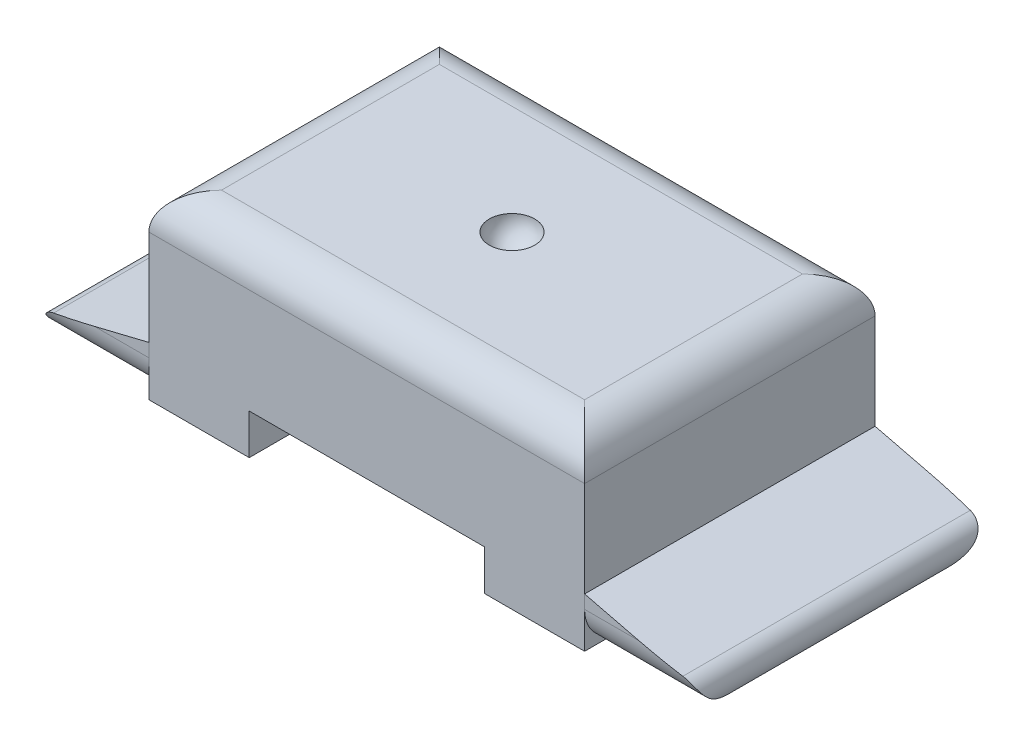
ISO-10303-21;
HEADER;
FILE_DESCRIPTION(('STEP AP214'),'2;1');
FILE_NAME('part.step','',(''),(''),'','','');
FILE_SCHEMA(('AUTOMOTIVE_DESIGN { 1 0 10303 214 1 1 1 1 }'));
ENDSEC;
DATA;
#1=APPLICATION_CONTEXT('core data for automotive mechanical design processes');
#2=APPLICATION_PROTOCOL_DEFINITION('international standard','automotive_design',2000,#1);
#3=PRODUCT_CONTEXT('',#1,'mechanical');
#4=PRODUCT('Part','Part','',(#3));
#5=PRODUCT_RELATED_PRODUCT_CATEGORY('part','',(#4));
#6=PRODUCT_DEFINITION_FORMATION('','',#4);
#7=PRODUCT_DEFINITION_CONTEXT('part definition',#1,'design');
#8=PRODUCT_DEFINITION('design','',#6,#7);
#9=PRODUCT_DEFINITION_SHAPE('','',#8);
#10=(LENGTH_UNIT() NAMED_UNIT(*) SI_UNIT(.MILLI.,.METRE.));
#11=(NAMED_UNIT(*) PLANE_ANGLE_UNIT() SI_UNIT($,.RADIAN.));
#12=(NAMED_UNIT(*) SI_UNIT($,.STERADIAN.) SOLID_ANGLE_UNIT());
#13=UNCERTAINTY_MEASURE_WITH_UNIT(LENGTH_MEASURE(1.E-05),#10,'distance_accuracy_value','');
#14=(GEOMETRIC_REPRESENTATION_CONTEXT(3) GLOBAL_UNCERTAINTY_ASSIGNED_CONTEXT((#13)) GLOBAL_UNIT_ASSIGNED_CONTEXT((#10,
#11,#12)) REPRESENTATION_CONTEXT('',''));
#15=CARTESIAN_POINT('',(0.,0.,0.));
#16=DIRECTION('',(0.,0.,1.));
#17=DIRECTION('',(1.,0.,0.));
#18=AXIS2_PLACEMENT_3D('',#15,#16,#17);
#19=CARTESIAN_POINT('',(0.899927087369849,0.,0.4));
#20=DIRECTION('',(0.,-1.,0.));
#21=DIRECTION('',(0.,0.,-1.));
#22=AXIS2_PLACEMENT_3D('',#19,#20,#21);
#23=PLANE('',#22);
#24=DIRECTION('',(1.,0.,0.));
#25=VECTOR('',#24,1.);
#26=CARTESIAN_POINT('',(0.815128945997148,0.,0.3));
#27=LINE('',#26,#25);
#28=CARTESIAN_POINT('',(0.6,0.,0.3));
#29=VERTEX_POINT('',#28);
#30=CARTESIAN_POINT('',(0.899927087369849,0.,0.3));
#31=VERTEX_POINT('',#30);
#32=EDGE_CURVE('P0_E76',#29,#31,#27,.T.);
#33=ORIENTED_EDGE('',*,*,#32,.F.);
#34=DIRECTION('',(0.,0.,1.));
#35=VECTOR('',#34,1.);
#36=CARTESIAN_POINT('',(0.6,0.,0.4));
#37=LINE('',#36,#35);
#38=CARTESIAN_POINT('',(0.6,0.,-0.3));
#39=VERTEX_POINT('',#38);
#40=EDGE_CURVE('P0_E75',#39,#29,#37,.T.);
#41=ORIENTED_EDGE('',*,*,#40,.F.);
#42=DIRECTION('',(1.,0.,0.));
#43=VECTOR('',#42,1.);
#44=CARTESIAN_POINT('',(0.8262338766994,0.,-0.3));
#45=LINE('',#44,#43);
#46=CARTESIAN_POINT('',(0.899927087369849,0.,-0.3));
#47=VERTEX_POINT('',#46);
#48=EDGE_CURVE('P0_E64',#47,#39,#45,.F.);
#49=ORIENTED_EDGE('',*,*,#48,.F.);
#50=DIRECTION('',(0.,0.,-1.));
#51=VECTOR('',#50,1.);
#52=CARTESIAN_POINT('',(0.899927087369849,0.,0.4));
#53=LINE('',#52,#51);
#54=EDGE_CURVE('P0_E100',#31,#47,#53,.T.);
#55=ORIENTED_EDGE('',*,*,#54,.F.);
#56=EDGE_LOOP('',(#33,#41,#49,#55));
#57=FACE_BOUND('',#56,.T.);
#58=ADVANCED_FACE('P0_F16',(#57),#23,.T.);
#59=CARTESIAN_POINT('',(0.8262338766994,0.1,-0.3));
#60=DIRECTION('',(1.,0.,0.));
#61=DIRECTION('',(0.,0.,-1.));
#62=AXIS2_PLACEMENT_3D('',#59,#60,#61);
#63=CYLINDRICAL_SURFACE('',#62,0.1);
#64=DIRECTION('',(-1.,0.,0.));
#65=VECTOR('',#64,1.);
#66=CARTESIAN_POINT('',(0.752540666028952,0.1,-0.4));
#67=LINE('',#66,#65);
#68=CARTESIAN_POINT('',(0.750335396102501,0.1,-0.4));
#69=VERTEX_POINT('',#68);
#70=CARTESIAN_POINT('',(0.6,0.1,-0.4));
#71=VERTEX_POINT('',#70);
#72=EDGE_CURVE('P0_E72',#69,#71,#67,.T.);
#73=ORIENTED_EDGE('',*,*,#72,.F.);
#74=CARTESIAN_POINT('',(0.750335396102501,0.1,-0.3));
#75=DIRECTION('',(0.237669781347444,0.971346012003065,0.));
#76=DIRECTION('',(0.971346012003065,-0.237669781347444,0.));
#77=AXIS2_PLACEMENT_3D('',#74,#75,#76);
#78=ELLIPSE('',#77,0.420751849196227,0.1);
#79=CARTESIAN_POINT('',(0.866375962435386,0.0716070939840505,-0.395884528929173));
#80=VERTEX_POINT('',#79);
#81=EDGE_CURVE('P0_E96',#80,#69,#78,.T.);
#82=ORIENTED_EDGE('',*,*,#81,.F.);
#83=CARTESIAN_POINT('',(0.899927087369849,0.,-0.3));
#84=CARTESIAN_POINT('',(0.899903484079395,-3.36777238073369E-06,-0.305248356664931));
#85=CARTESIAN_POINT('',(0.90012986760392,0.000412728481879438,-0.310482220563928));
#86=CARTESIAN_POINT('',(0.900886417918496,0.0020487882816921,-0.320799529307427));
#87=CARTESIAN_POINT('',(0.901416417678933,0.00326830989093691,-0.325883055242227));
#88=CARTESIAN_POINT('',(0.902591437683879,0.00649552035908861,-0.335843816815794));
#89=CARTESIAN_POINT('',(0.903237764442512,0.00851251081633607,-0.340717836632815));
#90=CARTESIAN_POINT('',(0.90433972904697,0.0132994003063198,-0.350106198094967));
#91=CARTESIAN_POINT('',(0.904795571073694,0.0160684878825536,-0.354620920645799));
#92=CARTESIAN_POINT('',(0.905121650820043,0.0213957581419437,-0.361931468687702));
#93=CARTESIAN_POINT('',(0.905123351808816,0.0237823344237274,-0.364846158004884));
#94=CARTESIAN_POINT('',(0.904719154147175,0.0288538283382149,-0.370371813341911));
#95=CARTESIAN_POINT('',(0.904314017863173,0.0315381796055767,-0.372983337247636));
#96=CARTESIAN_POINT('',(0.903087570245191,0.0365659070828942,-0.377362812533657));
#97=CARTESIAN_POINT('',(0.902361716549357,0.0388750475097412,-0.379196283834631));
#98=CARTESIAN_POINT('',(0.900491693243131,0.0435326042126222,-0.382581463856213));
#99=CARTESIAN_POINT('',(0.899347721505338,0.0458810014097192,-0.384133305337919));
#100=CARTESIAN_POINT('',(0.89660028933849,0.0505129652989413,-0.386939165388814));
#101=CARTESIAN_POINT('',(0.894994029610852,0.0527960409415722,-0.388191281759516));
#102=CARTESIAN_POINT('',(0.891335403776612,0.0571454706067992,-0.39038494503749));
#103=CARTESIAN_POINT('',(0.889283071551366,0.0592118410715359,-0.391326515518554));
#104=CARTESIAN_POINT('',(0.885029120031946,0.062799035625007,-0.392841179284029));
#105=CARTESIAN_POINT('',(0.882866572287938,0.0643545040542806,-0.393442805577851));
#106=CARTESIAN_POINT('',(0.878291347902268,0.0671203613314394,-0.394451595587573));
#107=CARTESIAN_POINT('',(0.875878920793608,0.0683310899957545,-0.394858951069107));
#108=CARTESIAN_POINT('',(0.872242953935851,0.0698049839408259,-0.395333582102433));
#109=CARTESIAN_POINT('',(0.871088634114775,0.0702247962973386,-0.39546516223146));
#110=CARTESIAN_POINT('',(0.868752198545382,0.0709796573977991,-0.395697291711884));
#111=CARTESIAN_POINT('',(0.867570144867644,0.0713148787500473,-0.395797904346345));
#112=CARTESIAN_POINT('',(0.86637596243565,0.071607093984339,-0.395884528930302));
#113=B_SPLINE_CURVE_WITH_KNOTS('',3,(#83,#84,#85,#86,#87,#88,#89,#90,#91,#92,#93,#94,#95,#96,
#97,#98,#99,#100,#101,#102,#103,#104,#105,#106,#107,#108,#109,#110,#111,#112),.UNSPECIFIED.,.F.,
.F.,(4,2,2,2,2,2,2,2,2,2,2,2,2,2,4),(0.,0.015701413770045,0.0313941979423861,0.0472756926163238,
0.063140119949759,0.0744051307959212,0.0856490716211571,0.0947220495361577,0.103790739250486,
0.112915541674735,0.122039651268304,0.130193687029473,0.138339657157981,0.142042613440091,
0.145737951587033),.UNSPECIFIED.);
#114=EDGE_CURVE('P0_E68',#47,#80,#113,.T.);
#115=ORIENTED_EDGE('',*,*,#114,.F.);
#116=ORIENTED_EDGE('',*,*,#48,.T.);
#117=CARTESIAN_POINT('',(0.6,0.1,-0.3));
#118=DIRECTION('',(1.,0.,0.));
#119=DIRECTION('',(0.,0.,-1.));
#120=AXIS2_PLACEMENT_3D('',#117,#118,#119);
#121=CIRCLE('',#120,0.1);
#122=EDGE_CURVE('P0_E20',#71,#39,#121,.F.);
#123=ORIENTED_EDGE('',*,*,#122,.F.);
#124=EDGE_LOOP('',(#73,#82,#115,#116,#123));
#125=FACE_BOUND('',#124,.T.);
#126=ADVANCED_FACE('P0_F66',(#125),#63,.T.);
#127=CARTESIAN_POINT('',(0.752540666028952,0.0683920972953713,-0.4));
#128=DIRECTION('',(0.,0.,-1.));
#129=DIRECTION('',(-1.,0.,0.));
#130=AXIS2_PLACEMENT_3D('',#127,#128,#129);
#131=PLANE('',#130);
#132=DIRECTION('',(0.,1.,0.));
#133=VECTOR('',#132,1.);
#134=CARTESIAN_POINT('',(0.6,0.,-0.4));
#135=LINE('',#134,#133);
#136=CARTESIAN_POINT('',(0.6,0.136784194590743,-0.4));
#137=VERTEX_POINT('',#136);
#138=EDGE_CURVE('P0_E80',#137,#71,#135,.F.);
#139=ORIENTED_EDGE('',*,*,#138,.F.);
#140=DIRECTION('',(-0.971346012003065,0.237669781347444,0.));
#141=VECTOR('',#140,1.);
#142=CARTESIAN_POINT('',(0.6,0.136784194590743,-0.4));
#143=LINE('',#142,#141);
#144=EDGE_CURVE('P0_E99',#69,#137,#143,.T.);
#145=ORIENTED_EDGE('',*,*,#144,.F.);
#146=ORIENTED_EDGE('',*,*,#72,.T.);
#147=EDGE_LOOP('',(#139,#145,#146));
#148=FACE_BOUND('',#147,.T.);
#149=ADVANCED_FACE('P0_F122',(#148),#131,.T.);
#150=CARTESIAN_POINT('',(0.6,0.,0.4));
#151=DIRECTION('',(-1.,0.,0.));
#152=DIRECTION('',(0.,0.,1.));
#153=AXIS2_PLACEMENT_3D('',#150,#151,#152);
#154=PLANE('',#153);
#155=DIRECTION('',(0.,0.,1.));
#156=VECTOR('',#155,1.);
#157=CARTESIAN_POINT('',(0.6,0.136784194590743,0.4));
#158=LINE('',#157,#156);
#159=CARTESIAN_POINT('',(0.6,0.136784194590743,0.4));
#160=VERTEX_POINT('',#159);
#161=EDGE_CURVE('P0_E151',#137,#160,#158,.T.);
#162=ORIENTED_EDGE('',*,*,#161,.F.);
#163=ORIENTED_EDGE('',*,*,#138,.T.);
#164=ORIENTED_EDGE('',*,*,#122,.T.);
#165=ORIENTED_EDGE('',*,*,#40,.T.);
#166=CARTESIAN_POINT('',(0.6,0.1,0.3));
#167=DIRECTION('',(1.,0.,0.));
#168=DIRECTION('',(0.,0.,-1.));
#169=AXIS2_PLACEMENT_3D('',#166,#167,#168);
#170=CIRCLE('',#169,0.1);
#171=CARTESIAN_POINT('',(0.6,0.1,0.4));
#172=VERTEX_POINT('',#171);
#173=EDGE_CURVE('P0_E142',#172,#29,#170,.T.);
#174=ORIENTED_EDGE('',*,*,#173,.F.);
#175=DIRECTION('',(0.,1.,0.));
#176=VECTOR('',#175,1.);
#177=CARTESIAN_POINT('',(0.6,0.0522792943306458,0.4));
#178=LINE('',#177,#176);
#179=EDGE_CURVE('P0_E143',#160,#172,#178,.F.);
#180=ORIENTED_EDGE('',*,*,#179,.F.);
#181=EDGE_LOOP('',(#162,#163,#164,#165,#174,#180));
#182=FACE_BOUND('',#181,.T.);
#183=ADVANCED_FACE('P0_F84',(#182),#154,.T.);
#184=CARTESIAN_POINT('',(0.730330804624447,0.0522792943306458,0.4));
#185=DIRECTION('',(0.,0.,1.));
#186=DIRECTION('',(1.,0.,0.));
#187=AXIS2_PLACEMENT_3D('',#184,#185,#186);
#188=PLANE('',#187);
#189=DIRECTION('',(-0.971346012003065,0.237669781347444,0.));
#190=VECTOR('',#189,1.);
#191=CARTESIAN_POINT('',(0.6,0.136784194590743,0.4));
#192=LINE('',#191,#190);
#193=CARTESIAN_POINT('',(0.750335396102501,0.1,0.4));
#194=VERTEX_POINT('',#193);
#195=EDGE_CURVE('P0_E95',#160,#194,#192,.F.);
#196=ORIENTED_EDGE('',*,*,#195,.F.);
#197=ORIENTED_EDGE('',*,*,#179,.T.);
#198=DIRECTION('',(1.,0.,0.));
#199=VECTOR('',#198,1.);
#200=CARTESIAN_POINT('',(0.815128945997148,0.1,0.4));
#201=LINE('',#200,#199);
#202=EDGE_CURVE('P0_E141',#194,#172,#201,.F.);
#203=ORIENTED_EDGE('',*,*,#202,.F.);
#204=EDGE_LOOP('',(#196,#197,#203));
#205=FACE_BOUND('',#204,.T.);
#206=ADVANCED_FACE('P0_F116',(#205),#188,.T.);
#207=CARTESIAN_POINT('',(0.815128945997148,0.1,0.3));
#208=DIRECTION('',(1.,0.,0.));
#209=DIRECTION('',(0.,0.,-1.));
#210=AXIS2_PLACEMENT_3D('',#207,#208,#209);
#211=CYLINDRICAL_SURFACE('',#210,0.1);
#212=ORIENTED_EDGE('',*,*,#32,.T.);
#213=CARTESIAN_POINT('',(0.866375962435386,0.0716070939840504,0.395884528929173));
#214=CARTESIAN_POINT('',(0.868992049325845,0.0709705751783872,0.395693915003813));
#215=CARTESIAN_POINT('',(0.871551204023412,0.0701205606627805,0.395437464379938));
#216=CARTESIAN_POINT('',(0.876485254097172,0.0680400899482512,0.39476215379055));
#217=CARTESIAN_POINT('',(0.878860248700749,0.0668098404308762,0.394343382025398));
#218=CARTESIAN_POINT('',(0.883361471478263,0.0640128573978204,0.393311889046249));
#219=CARTESIAN_POINT('',(0.885487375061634,0.0624456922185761,0.392698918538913));
#220=CARTESIAN_POINT('',(0.889427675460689,0.059049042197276,0.391249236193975));
#221=CARTESIAN_POINT('',(0.891242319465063,0.0572197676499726,0.390412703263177));
#222=CARTESIAN_POINT('',(0.89450579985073,0.0534067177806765,0.388507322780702));
#223=CARTESIAN_POINT('',(0.895958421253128,0.0514248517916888,0.38744111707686));
#224=CARTESIAN_POINT('',(0.898513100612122,0.0473804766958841,0.38506870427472));
#225=CARTESIAN_POINT('',(0.899614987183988,0.0453179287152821,0.383762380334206));
#226=CARTESIAN_POINT('',(0.901527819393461,0.0410999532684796,0.380855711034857));
#227=CARTESIAN_POINT('',(0.902322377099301,0.0389447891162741,0.379244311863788));
#228=CARTESIAN_POINT('',(0.903585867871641,0.0347190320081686,0.375801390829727));
#229=CARTESIAN_POINT('',(0.904054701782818,0.0326484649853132,0.37396980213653));
#230=CARTESIAN_POINT('',(0.90489676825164,0.0276032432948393,0.369112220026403));
#231=CARTESIAN_POINT('',(0.905093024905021,0.0247193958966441,0.365960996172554));
#232=CARTESIAN_POINT('',(0.905068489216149,0.0193759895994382,0.359313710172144));
#233=CARTESIAN_POINT('',(0.904846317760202,0.0169178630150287,0.355816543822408));
#234=CARTESIAN_POINT('',(0.904068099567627,0.0117722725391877,0.347405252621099));
#235=CARTESIAN_POINT('',(0.903428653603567,0.0092583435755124,0.34239290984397));
#236=CARTESIAN_POINT('',(0.902134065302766,0.0051040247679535,0.33202933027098));
#237=CARTESIAN_POINT('',(0.901478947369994,0.00346235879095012,0.32667860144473));
#238=CARTESIAN_POINT('',(0.900647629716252,0.00152282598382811,0.31774419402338));
#239=CARTESIAN_POINT('',(0.900383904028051,0.000953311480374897,0.314226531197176));
#240=CARTESIAN_POINT('',(0.900020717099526,0.000191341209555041,0.307140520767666));
#241=CARTESIAN_POINT('',(0.899921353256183,-8.91001731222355E-07,0.303572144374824));
#242=CARTESIAN_POINT('',(0.899927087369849,0.,0.3));
#243=B_SPLINE_CURVE_WITH_KNOTS('',3,(#213,#214,#215,#216,#217,#218,#219,#220,#221,#222,#223,
#224,#225,#226,#227,#228,#229,#230,#231,#232,#233,#234,#235,#236,#237,#238,#239,#240,#241,#242),
.UNSPECIFIED.,.F.,.F.,(4,2,2,2,2,2,2,2,2,2,2,2,2,2,4),(0.,0.00808803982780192,
0.0161716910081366,0.0242657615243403,0.0323533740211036,0.0403525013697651,0.0483555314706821,
0.0567403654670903,0.0651277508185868,0.0778836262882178,0.0906816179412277,0.107529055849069,
0.124351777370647,0.135048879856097,0.145752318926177),.UNSPECIFIED.);
#244=CARTESIAN_POINT('',(0.866375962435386,0.0716070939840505,0.395884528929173));
#245=VERTEX_POINT('',#244);
#246=EDGE_CURVE('P0_E35',#245,#31,#243,.T.);
#247=ORIENTED_EDGE('',*,*,#246,.F.);
#248=CARTESIAN_POINT('',(0.750335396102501,0.1,0.3));
#249=DIRECTION('',(0.237669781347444,0.971346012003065,0.));
#250=DIRECTION('',(0.971346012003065,-0.237669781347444,0.));
#251=AXIS2_PLACEMENT_3D('',#248,#249,#250);
#252=ELLIPSE('',#251,0.420751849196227,0.1);
#253=EDGE_CURVE('P0_E26',#194,#245,#252,.T.);
#254=ORIENTED_EDGE('',*,*,#253,.F.);
#255=ORIENTED_EDGE('',*,*,#202,.T.);
#256=ORIENTED_EDGE('',*,*,#173,.T.);
#257=EDGE_LOOP('',(#212,#247,#254,#255,#256));
#258=FACE_BOUND('',#257,.T.);
#259=ADVANCED_FACE('P0_F112',(#258),#211,.T.);
#260=CARTESIAN_POINT('',(0.854308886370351,0.0222894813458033,0.4));
#261=DIRECTION('',(0.,0.,-1.));
#262=DIRECTION('',(-1.,0.,0.));
#263=AXIS2_PLACEMENT_3D('',#260,#261,#262);
#264=CYLINDRICAL_SURFACE('',#263,0.0507724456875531);
#265=ORIENTED_EDGE('',*,*,#246,.T.);
#266=ORIENTED_EDGE('',*,*,#54,.T.);
#267=ORIENTED_EDGE('',*,*,#114,.T.);
#268=DIRECTION('',(0.,0.,1.));
#269=VECTOR('',#268,1.);
#270=CARTESIAN_POINT('',(0.866375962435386,0.0716070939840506,0.4));
#271=LINE('',#270,#269);
#272=EDGE_CURVE('P0_E11',#245,#80,#271,.F.);
#273=ORIENTED_EDGE('',*,*,#272,.F.);
#274=EDGE_LOOP('',(#265,#266,#267,#273));
#275=FACE_BOUND('',#274,.T.);
#276=ADVANCED_FACE('P0_F110',(#275),#264,.T.);
#277=CARTESIAN_POINT('',(0.6,0.136784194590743,0.4));
#278=DIRECTION('',(0.237669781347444,0.971346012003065,0.));
#279=DIRECTION('',(-0.971346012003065,0.237669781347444,0.));
#280=AXIS2_PLACEMENT_3D('',#277,#278,#279);
#281=PLANE('',#280);
#282=ORIENTED_EDGE('',*,*,#253,.T.);
#283=ORIENTED_EDGE('',*,*,#272,.T.);
#284=ORIENTED_EDGE('',*,*,#81,.T.);
#285=ORIENTED_EDGE('',*,*,#144,.T.);
#286=ORIENTED_EDGE('',*,*,#161,.T.);
#287=ORIENTED_EDGE('',*,*,#195,.T.);
#288=EDGE_LOOP('',(#282,#283,#284,#285,#286,#287));
#289=FACE_BOUND('',#288,.T.);
#290=ADVANCED_FACE('P0_F18',(#289),#281,.T.);
#291=CLOSED_SHELL('',(#58,#126,#149,#183,#206,#259,#276,#290));
#292=MANIFOLD_SOLID_BREP('P0_B1',#291);
#293=CARTESIAN_POINT('',(-0.899927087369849,0.,0.4));
#294=DIRECTION('',(0.,1.,0.));
#295=DIRECTION('',(0.,0.,1.));
#296=AXIS2_PLACEMENT_3D('',#293,#294,#295);
#297=PLANE('',#296);
#298=DIRECTION('',(0.,0.,1.));
#299=VECTOR('',#298,1.);
#300=CARTESIAN_POINT('',(-0.6,0.,0.4));
#301=LINE('',#300,#299);
#302=CARTESIAN_POINT('',(-0.6,0.,-0.3));
#303=VERTEX_POINT('',#302);
#304=CARTESIAN_POINT('',(-0.6,0.,0.3));
#305=VERTEX_POINT('',#304);
#306=EDGE_CURVE('P1_E146',#303,#305,#301,.T.);
#307=ORIENTED_EDGE('',*,*,#306,.T.);
#308=DIRECTION('',(-1.,0.,0.));
#309=VECTOR('',#308,1.);
#310=CARTESIAN_POINT('',(-0.815128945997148,0.,0.3));
#311=LINE('',#310,#309);
#312=CARTESIAN_POINT('',(-0.899927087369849,0.,0.3));
#313=VERTEX_POINT('',#312);
#314=EDGE_CURVE('P1_E57',#313,#305,#311,.F.);
#315=ORIENTED_EDGE('',*,*,#314,.F.);
#316=DIRECTION('',(0.,0.,1.));
#317=VECTOR('',#316,1.);
#318=CARTESIAN_POINT('',(-0.899927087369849,0.,0.4));
#319=LINE('',#318,#317);
#320=CARTESIAN_POINT('',(-0.899927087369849,0.,-0.3));
#321=VERTEX_POINT('',#320);
#322=EDGE_CURVE('P1_E83',#321,#313,#319,.T.);
#323=ORIENTED_EDGE('',*,*,#322,.F.);
#324=DIRECTION('',(-1.,0.,0.));
#325=VECTOR('',#324,1.);
#326=CARTESIAN_POINT('',(-0.8262338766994,0.,-0.3));
#327=LINE('',#326,#325);
#328=EDGE_CURVE('P1_E104',#303,#321,#327,.T.);
#329=ORIENTED_EDGE('',*,*,#328,.F.);
#330=EDGE_LOOP('',(#307,#315,#323,#329));
#331=FACE_BOUND('',#330,.T.);
#332=ADVANCED_FACE('P1_F16',(#331),#297,.F.);
#333=CARTESIAN_POINT('',(-0.752540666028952,0.0683920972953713,-0.4));
#334=DIRECTION('',(0.,0.,1.));
#335=DIRECTION('',(1.,0.,0.));
#336=AXIS2_PLACEMENT_3D('',#333,#334,#335);
#337=PLANE('',#336);
#338=DIRECTION('',(0.971346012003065,0.237669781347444,0.));
#339=VECTOR('',#338,1.);
#340=CARTESIAN_POINT('',(-0.6,0.136784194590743,-0.4));
#341=LINE('',#340,#339);
#342=CARTESIAN_POINT('',(-0.750335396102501,0.1,-0.4));
#343=VERTEX_POINT('',#342);
#344=CARTESIAN_POINT('',(-0.6,0.136784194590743,-0.4));
#345=VERTEX_POINT('',#344);
#346=EDGE_CURVE('P1_E94',#343,#345,#341,.T.);
#347=ORIENTED_EDGE('',*,*,#346,.T.);
#348=DIRECTION('',(0.,1.,0.));
#349=VECTOR('',#348,1.);
#350=CARTESIAN_POINT('',(-0.6,0.,-0.4));
#351=LINE('',#350,#349);
#352=CARTESIAN_POINT('',(-0.6,0.1,-0.4));
#353=VERTEX_POINT('',#352);
#354=EDGE_CURVE('P1_E79',#345,#353,#351,.F.);
#355=ORIENTED_EDGE('',*,*,#354,.T.);
#356=DIRECTION('',(-1.,0.,0.));
#357=VECTOR('',#356,1.);
#358=CARTESIAN_POINT('',(-0.8262338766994,0.1,-0.4));
#359=LINE('',#358,#357);
#360=EDGE_CURVE('P1_E88',#343,#353,#359,.F.);
#361=ORIENTED_EDGE('',*,*,#360,.F.);
#362=EDGE_LOOP('',(#347,#355,#361));
#363=FACE_BOUND('',#362,.T.);
#364=ADVANCED_FACE('P1_F139',(#363),#337,.F.);
#365=CARTESIAN_POINT('',(-0.6,0.,0.4));
#366=DIRECTION('',(-1.,0.,0.));
#367=DIRECTION('',(0.,0.,1.));
#368=AXIS2_PLACEMENT_3D('',#365,#366,#367);
#369=PLANE('',#368);
#370=ORIENTED_EDGE('',*,*,#354,.F.);
#371=DIRECTION('',(0.,0.,1.));
#372=VECTOR('',#371,1.);
#373=CARTESIAN_POINT('',(-0.6,0.136784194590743,0.4));
#374=LINE('',#373,#372);
#375=CARTESIAN_POINT('',(-0.6,0.136784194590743,0.4));
#376=VERTEX_POINT('',#375);
#377=EDGE_CURVE('P1_E75',#345,#376,#374,.T.);
#378=ORIENTED_EDGE('',*,*,#377,.T.);
#379=DIRECTION('',(0.,1.,0.));
#380=VECTOR('',#379,1.);
#381=CARTESIAN_POINT('',(-0.6,0.0522792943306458,0.4));
#382=LINE('',#381,#380);
#383=CARTESIAN_POINT('',(-0.6,0.1,0.4));
#384=VERTEX_POINT('',#383);
#385=EDGE_CURVE('P1_E70',#376,#384,#382,.F.);
#386=ORIENTED_EDGE('',*,*,#385,.T.);
#387=CARTESIAN_POINT('',(-0.6,0.1,0.3));
#388=DIRECTION('',(-1.,0.,0.));
#389=DIRECTION('',(0.,0.,1.));
#390=AXIS2_PLACEMENT_3D('',#387,#388,#389);
#391=CIRCLE('',#390,0.1);
#392=EDGE_CURVE('P1_E20',#305,#384,#391,.T.);
#393=ORIENTED_EDGE('',*,*,#392,.F.);
#394=ORIENTED_EDGE('',*,*,#306,.F.);
#395=CARTESIAN_POINT('',(-0.6,0.1,-0.3));
#396=DIRECTION('',(-1.,0.,0.));
#397=DIRECTION('',(0.,0.,1.));
#398=AXIS2_PLACEMENT_3D('',#395,#396,#397);
#399=CIRCLE('',#398,0.1);
#400=EDGE_CURVE('P1_E105',#353,#303,#399,.T.);
#401=ORIENTED_EDGE('',*,*,#400,.F.);
#402=EDGE_LOOP('',(#370,#378,#386,#393,#394,#401));
#403=FACE_BOUND('',#402,.T.);
#404=ADVANCED_FACE('P1_F72',(#403),#369,.F.);
#405=CARTESIAN_POINT('',(-0.730330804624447,0.0522792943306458,0.4));
#406=DIRECTION('',(0.,0.,-1.));
#407=DIRECTION('',(-1.,0.,0.));
#408=AXIS2_PLACEMENT_3D('',#405,#406,#407);
#409=PLANE('',#408);
#410=ORIENTED_EDGE('',*,*,#385,.F.);
#411=DIRECTION('',(0.971346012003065,0.237669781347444,0.));
#412=VECTOR('',#411,1.);
#413=CARTESIAN_POINT('',(-0.6,0.136784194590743,0.4));
#414=LINE('',#413,#412);
#415=CARTESIAN_POINT('',(-0.750335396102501,0.1,0.4));
#416=VERTEX_POINT('',#415);
#417=EDGE_CURVE('P1_E82',#376,#416,#414,.F.);
#418=ORIENTED_EDGE('',*,*,#417,.T.);
#419=DIRECTION('',(-1.,0.,0.));
#420=VECTOR('',#419,1.);
#421=CARTESIAN_POINT('',(-0.815128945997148,0.1,0.4));
#422=LINE('',#421,#420);
#423=EDGE_CURVE('P1_E65',#384,#416,#422,.T.);
#424=ORIENTED_EDGE('',*,*,#423,.F.);
#425=EDGE_LOOP('',(#410,#418,#424));
#426=FACE_BOUND('',#425,.T.);
#427=ADVANCED_FACE('P1_F81',(#426),#409,.F.);
#428=CARTESIAN_POINT('',(-0.815128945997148,0.1,0.3));
#429=DIRECTION('',(-1.,0.,0.));
#430=DIRECTION('',(0.,0.,1.));
#431=AXIS2_PLACEMENT_3D('',#428,#429,#430);
#432=CYLINDRICAL_SURFACE('',#431,0.1);
#433=ORIENTED_EDGE('',*,*,#423,.T.);
#434=CARTESIAN_POINT('',(-0.750335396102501,0.1,0.3));
#435=DIRECTION('',(0.237669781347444,-0.971346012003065,0.));
#436=DIRECTION('',(-0.971346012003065,-0.237669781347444,0.));
#437=AXIS2_PLACEMENT_3D('',#434,#435,#436);
#438=ELLIPSE('',#437,0.420751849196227,0.1);
#439=CARTESIAN_POINT('',(-0.866375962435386,0.0716070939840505,0.395884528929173));
#440=VERTEX_POINT('',#439);
#441=EDGE_CURVE('P1_E97',#416,#440,#438,.T.);
#442=ORIENTED_EDGE('',*,*,#441,.T.);
#443=CARTESIAN_POINT('',(-0.899927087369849,0.,0.3));
#444=CARTESIAN_POINT('',(-0.899903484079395,-3.36777238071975E-06,0.305248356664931));
#445=CARTESIAN_POINT('',(-0.90012986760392,0.000412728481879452,0.310482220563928));
#446=CARTESIAN_POINT('',(-0.900886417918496,0.00204878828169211,0.320799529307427));
#447=CARTESIAN_POINT('',(-0.901416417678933,0.00326830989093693,0.325883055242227));
#448=CARTESIAN_POINT('',(-0.902591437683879,0.00649552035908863,0.335843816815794));
#449=CARTESIAN_POINT('',(-0.903237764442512,0.00851251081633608,0.340717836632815));
#450=CARTESIAN_POINT('',(-0.90433972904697,0.0132994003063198,0.350106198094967));
#451=CARTESIAN_POINT('',(-0.904795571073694,0.0160684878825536,0.354620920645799));
#452=CARTESIAN_POINT('',(-0.905121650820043,0.0213957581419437,0.361931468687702));
#453=CARTESIAN_POINT('',(-0.905123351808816,0.0237823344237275,0.364846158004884));
#454=CARTESIAN_POINT('',(-0.904719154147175,0.028853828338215,0.370371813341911));
#455=CARTESIAN_POINT('',(-0.904314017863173,0.0315381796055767,0.372983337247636));
#456=CARTESIAN_POINT('',(-0.903087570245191,0.0365659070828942,0.377362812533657));
#457=CARTESIAN_POINT('',(-0.902361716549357,0.0388750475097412,0.379196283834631));
#458=CARTESIAN_POINT('',(-0.900491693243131,0.0435326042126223,0.382581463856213));
#459=CARTESIAN_POINT('',(-0.899347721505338,0.0458810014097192,0.384133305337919));
#460=CARTESIAN_POINT('',(-0.89660028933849,0.0505129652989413,0.386939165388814));
#461=CARTESIAN_POINT('',(-0.894994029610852,0.0527960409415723,0.388191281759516));
#462=CARTESIAN_POINT('',(-0.891335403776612,0.0571454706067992,0.39038494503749));
#463=CARTESIAN_POINT('',(-0.889283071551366,0.0592118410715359,0.391326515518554));
#464=CARTESIAN_POINT('',(-0.885029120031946,0.062799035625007,0.392841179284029));
#465=CARTESIAN_POINT('',(-0.882866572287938,0.0643545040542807,0.393442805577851));
#466=CARTESIAN_POINT('',(-0.878291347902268,0.0671203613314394,0.394451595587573));
#467=CARTESIAN_POINT('',(-0.875878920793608,0.0683310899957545,0.394858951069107));
#468=CARTESIAN_POINT('',(-0.872242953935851,0.0698049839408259,0.395333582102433));
#469=CARTESIAN_POINT('',(-0.871088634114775,0.0702247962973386,0.39546516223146));
#470=CARTESIAN_POINT('',(-0.868752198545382,0.0709796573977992,0.395697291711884));
#471=CARTESIAN_POINT('',(-0.867570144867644,0.0713148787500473,0.395797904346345));
#472=CARTESIAN_POINT('',(-0.86637596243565,0.071607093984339,0.395884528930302));
#473=B_SPLINE_CURVE_WITH_KNOTS('',3,(#443,#444,#445,#446,#447,#448,#449,#450,#451,#452,#453,
#454,#455,#456,#457,#458,#459,#460,#461,#462,#463,#464,#465,#466,#467,#468,#469,#470,#471,#472),
.UNSPECIFIED.,.F.,.F.,(4,2,2,2,2,2,2,2,2,2,2,2,2,2,4),(0.,0.015701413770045,0.0313941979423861,
0.0472756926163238,0.063140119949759,0.0744051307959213,0.0856490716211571,0.0947220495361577,
0.103790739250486,0.112915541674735,0.122039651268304,0.130193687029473,0.138339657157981,
0.142042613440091,0.145737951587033),.UNSPECIFIED.);
#474=EDGE_CURVE('P1_E85',#313,#440,#473,.T.);
#475=ORIENTED_EDGE('',*,*,#474,.F.);
#476=ORIENTED_EDGE('',*,*,#314,.T.);
#477=ORIENTED_EDGE('',*,*,#392,.T.);
#478=EDGE_LOOP('',(#433,#442,#475,#476,#477));
#479=FACE_BOUND('',#478,.T.);
#480=ADVANCED_FACE('P1_F62',(#479),#432,.T.);
#481=CARTESIAN_POINT('',(-0.854308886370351,0.0222894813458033,0.4));
#482=DIRECTION('',(0.,0.,1.));
#483=DIRECTION('',(1.,0.,0.));
#484=AXIS2_PLACEMENT_3D('',#481,#482,#483);
#485=CYLINDRICAL_SURFACE('',#484,0.0507724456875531);
#486=ORIENTED_EDGE('',*,*,#474,.T.);
#487=DIRECTION('',(0.,0.,1.));
#488=VECTOR('',#487,1.);
#489=CARTESIAN_POINT('',(-0.866375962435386,0.0716070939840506,0.4));
#490=LINE('',#489,#488);
#491=CARTESIAN_POINT('',(-0.866375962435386,0.0716070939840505,-0.395884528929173));
#492=VERTEX_POINT('',#491);
#493=EDGE_CURVE('P1_E26',#440,#492,#490,.F.);
#494=ORIENTED_EDGE('',*,*,#493,.T.);
#495=CARTESIAN_POINT('',(-0.899927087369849,0.,-0.3));
#496=CARTESIAN_POINT('',(-0.899903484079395,-3.36777238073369E-06,-0.305248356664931));
#497=CARTESIAN_POINT('',(-0.90012986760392,0.000412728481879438,-0.310482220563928));
#498=CARTESIAN_POINT('',(-0.900886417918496,0.0020487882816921,-0.320799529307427));
#499=CARTESIAN_POINT('',(-0.901416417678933,0.00326830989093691,-0.325883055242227));
#500=CARTESIAN_POINT('',(-0.902591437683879,0.00649552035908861,-0.335843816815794));
#501=CARTESIAN_POINT('',(-0.903237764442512,0.00851251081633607,-0.340717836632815));
#502=CARTESIAN_POINT('',(-0.90433972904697,0.0132994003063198,-0.350106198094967));
#503=CARTESIAN_POINT('',(-0.904795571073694,0.0160684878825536,-0.354620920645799));
#504=CARTESIAN_POINT('',(-0.905121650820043,0.0213957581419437,-0.361931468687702));
#505=CARTESIAN_POINT('',(-0.905123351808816,0.0237823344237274,-0.364846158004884));
#506=CARTESIAN_POINT('',(-0.904719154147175,0.0288538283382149,-0.370371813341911));
#507=CARTESIAN_POINT('',(-0.904314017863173,0.0315381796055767,-0.372983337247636));
#508=CARTESIAN_POINT('',(-0.903087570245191,0.0365659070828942,-0.377362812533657));
#509=CARTESIAN_POINT('',(-0.902361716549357,0.0388750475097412,-0.379196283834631));
#510=CARTESIAN_POINT('',(-0.900491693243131,0.0435326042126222,-0.382581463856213));
#511=CARTESIAN_POINT('',(-0.899347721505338,0.0458810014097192,-0.384133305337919));
#512=CARTESIAN_POINT('',(-0.89660028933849,0.0505129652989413,-0.386939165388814));
#513=CARTESIAN_POINT('',(-0.894994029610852,0.0527960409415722,-0.388191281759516));
#514=CARTESIAN_POINT('',(-0.891335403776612,0.0571454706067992,-0.39038494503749));
#515=CARTESIAN_POINT('',(-0.889283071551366,0.0592118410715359,-0.391326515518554));
#516=CARTESIAN_POINT('',(-0.885029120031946,0.062799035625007,-0.392841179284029));
#517=CARTESIAN_POINT('',(-0.882866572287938,0.0643545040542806,-0.393442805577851));
#518=CARTESIAN_POINT('',(-0.878291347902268,0.0671203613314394,-0.394451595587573));
#519=CARTESIAN_POINT('',(-0.875878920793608,0.0683310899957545,-0.394858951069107));
#520=CARTESIAN_POINT('',(-0.872242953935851,0.0698049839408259,-0.395333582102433));
#521=CARTESIAN_POINT('',(-0.871088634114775,0.0702247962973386,-0.39546516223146));
#522=CARTESIAN_POINT('',(-0.868752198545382,0.0709796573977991,-0.395697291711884));
#523=CARTESIAN_POINT('',(-0.867570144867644,0.0713148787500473,-0.395797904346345));
#524=CARTESIAN_POINT('',(-0.86637596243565,0.071607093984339,-0.395884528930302));
#525=B_SPLINE_CURVE_WITH_KNOTS('',3,(#495,#496,#497,#498,#499,#500,#501,#502,#503,#504,#505,
#506,#507,#508,#509,#510,#511,#512,#513,#514,#515,#516,#517,#518,#519,#520,#521,#522,#523,#524),
.UNSPECIFIED.,.F.,.F.,(4,2,2,2,2,2,2,2,2,2,2,2,2,2,4),(0.,0.015701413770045,0.0313941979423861,
0.0472756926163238,0.063140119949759,0.0744051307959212,0.0856490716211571,0.0947220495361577,
0.103790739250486,0.112915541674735,0.122039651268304,0.130193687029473,0.138339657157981,
0.142042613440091,0.145737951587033),.UNSPECIFIED.);
#526=EDGE_CURVE('P1_E34',#321,#492,#525,.T.);
#527=ORIENTED_EDGE('',*,*,#526,.F.);
#528=ORIENTED_EDGE('',*,*,#322,.T.);
#529=EDGE_LOOP('',(#486,#494,#527,#528));
#530=FACE_BOUND('',#529,.T.);
#531=ADVANCED_FACE('P1_F108',(#530),#485,.T.);
#532=CARTESIAN_POINT('',(-0.8262338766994,0.1,-0.3));
#533=DIRECTION('',(-1.,0.,0.));
#534=DIRECTION('',(0.,0.,1.));
#535=AXIS2_PLACEMENT_3D('',#532,#533,#534);
#536=CYLINDRICAL_SURFACE('',#535,0.1);
#537=ORIENTED_EDGE('',*,*,#328,.T.);
#538=ORIENTED_EDGE('',*,*,#526,.T.);
#539=CARTESIAN_POINT('',(-0.750335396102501,0.1,-0.3));
#540=DIRECTION('',(0.237669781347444,-0.971346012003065,0.));
#541=DIRECTION('',(-0.971346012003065,-0.237669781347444,0.));
#542=AXIS2_PLACEMENT_3D('',#539,#540,#541);
#543=ELLIPSE('',#542,0.420751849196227,0.1);
#544=EDGE_CURVE('P1_E11',#492,#343,#543,.T.);
#545=ORIENTED_EDGE('',*,*,#544,.T.);
#546=ORIENTED_EDGE('',*,*,#360,.T.);
#547=ORIENTED_EDGE('',*,*,#400,.T.);
#548=EDGE_LOOP('',(#537,#538,#545,#546,#547));
#549=FACE_BOUND('',#548,.T.);
#550=ADVANCED_FACE('P1_F106',(#549),#536,.T.);
#551=CARTESIAN_POINT('',(-0.6,0.136784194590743,0.4));
#552=DIRECTION('',(0.237669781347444,-0.971346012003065,0.));
#553=DIRECTION('',(0.971346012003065,0.237669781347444,0.));
#554=AXIS2_PLACEMENT_3D('',#551,#552,#553);
#555=PLANE('',#554);
#556=ORIENTED_EDGE('',*,*,#493,.F.);
#557=ORIENTED_EDGE('',*,*,#441,.F.);
#558=ORIENTED_EDGE('',*,*,#417,.F.);
#559=ORIENTED_EDGE('',*,*,#377,.F.);
#560=ORIENTED_EDGE('',*,*,#346,.F.);
#561=ORIENTED_EDGE('',*,*,#544,.F.);
#562=EDGE_LOOP('',(#556,#557,#558,#559,#560,#561));
#563=FACE_BOUND('',#562,.T.);
#564=ADVANCED_FACE('P1_F18',(#563),#555,.F.);
#565=CLOSED_SHELL('',(#332,#364,#404,#427,#480,#531,#550,#564));
#566=MANIFOLD_SOLID_BREP('P1_B1',#565);
#567=CARTESIAN_POINT('',(0.,0.,0.));
#568=DIRECTION('',(0.,1.,0.));
#569=DIRECTION('',(0.,0.,1.));
#570=AXIS2_PLACEMENT_3D('',#567,#568,#569);
#571=PLANE('',#570);
#572=DIRECTION('',(1.,0.,0.));
#573=VECTOR('',#572,1.);
#574=CARTESIAN_POINT('',(-0.6,0.,0.4));
#575=LINE('',#574,#573);
#576=CARTESIAN_POINT('',(-0.6,0.,0.4));
#577=VERTEX_POINT('',#576);
#578=CARTESIAN_POINT('',(-0.323751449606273,0.,0.4));
#579=VERTEX_POINT('',#578);
#580=EDGE_CURVE('P2_E105',#577,#579,#575,.T.);
#581=ORIENTED_EDGE('',*,*,#580,.F.);
#582=DIRECTION('',(0.,0.,1.));
#583=VECTOR('',#582,1.);
#584=CARTESIAN_POINT('',(-0.6,0.,-0.4));
#585=LINE('',#584,#583);
#586=CARTESIAN_POINT('',(-0.6,0.,-0.4));
#587=VERTEX_POINT('',#586);
#588=EDGE_CURVE('P2_E106',#587,#577,#585,.T.);
#589=ORIENTED_EDGE('',*,*,#588,.F.);
#590=DIRECTION('',(-1.,0.,0.));
#591=VECTOR('',#590,1.);
#592=CARTESIAN_POINT('',(0.6,0.,-0.4));
#593=LINE('',#592,#591);
#594=CARTESIAN_POINT('',(-0.323751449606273,0.,-0.4));
#595=VERTEX_POINT('',#594);
#596=EDGE_CURVE('P2_E112',#595,#587,#593,.T.);
#597=ORIENTED_EDGE('',*,*,#596,.F.);
#598=DIRECTION('',(0.,0.,1.));
#599=VECTOR('',#598,1.);
#600=CARTESIAN_POINT('',(-0.323751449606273,0.,0.4));
#601=LINE('',#600,#599);
#602=EDGE_CURVE('P2_E153',#595,#579,#601,.T.);
#603=ORIENTED_EDGE('',*,*,#602,.T.);
#604=EDGE_LOOP('',(#581,#589,#597,#603));
#605=FACE_BOUND('',#604,.T.);
#606=ADVANCED_FACE('P2_F15',(#605),#571,.F.);
#607=CARTESIAN_POINT('',(-0.323751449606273,-0.111294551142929,0.4));
#608=DIRECTION('',(-1.,0.,0.));
#609=DIRECTION('',(0.,0.,1.));
#610=AXIS2_PLACEMENT_3D('',#607,#608,#609);
#611=PLANE('',#610);
#612=DIRECTION('',(0.,0.,1.));
#613=VECTOR('',#612,1.);
#614=CARTESIAN_POINT('',(-0.323751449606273,0.111294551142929,0.4));
#615=LINE('',#614,#613);
#616=CARTESIAN_POINT('',(-0.323751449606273,0.111294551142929,-0.4));
#617=VERTEX_POINT('',#616);
#618=CARTESIAN_POINT('',(-0.323751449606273,0.111294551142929,0.4));
#619=VERTEX_POINT('',#618);
#620=EDGE_CURVE('P2_E143',#617,#619,#615,.T.);
#621=ORIENTED_EDGE('',*,*,#620,.T.);
#622=DIRECTION('',(0.,1.,0.));
#623=VECTOR('',#622,1.);
#624=CARTESIAN_POINT('',(-0.323751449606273,0.,0.4));
#625=LINE('',#624,#623);
#626=EDGE_CURVE('P2_E148',#579,#619,#625,.T.);
#627=ORIENTED_EDGE('',*,*,#626,.F.);
#628=ORIENTED_EDGE('',*,*,#602,.F.);
#629=DIRECTION('',(0.,1.,0.));
#630=VECTOR('',#629,1.);
#631=CARTESIAN_POINT('',(-0.323751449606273,0.,-0.4));
#632=LINE('',#631,#630);
#633=EDGE_CURVE('P2_E174',#617,#595,#632,.F.);
#634=ORIENTED_EDGE('',*,*,#633,.F.);
#635=EDGE_LOOP('',(#621,#627,#628,#634));
#636=FACE_BOUND('',#635,.T.);
#637=ADVANCED_FACE('P2_F246',(#636),#611,.F.);
#638=CARTESIAN_POINT('',(-0.323751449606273,0.111294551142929,0.4));
#639=DIRECTION('',(0.,1.,0.));
#640=DIRECTION('',(0.,0.,1.));
#641=AXIS2_PLACEMENT_3D('',#638,#639,#640);
#642=PLANE('',#641);
#643=DIRECTION('',(0.,0.,-1.));
#644=VECTOR('',#643,1.);
#645=CARTESIAN_POINT('',(0.323751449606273,0.111294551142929,0.4));
#646=LINE('',#645,#644);
#647=CARTESIAN_POINT('',(0.323751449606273,0.111294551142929,-0.4));
#648=VERTEX_POINT('',#647);
#649=CARTESIAN_POINT('',(0.323751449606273,0.111294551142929,0.4));
#650=VERTEX_POINT('',#649);
#651=EDGE_CURVE('P2_E133',#648,#650,#646,.F.);
#652=ORIENTED_EDGE('',*,*,#651,.T.);
#653=DIRECTION('',(1.,0.,0.));
#654=VECTOR('',#653,1.);
#655=CARTESIAN_POINT('',(-0.6,0.111294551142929,0.4));
#656=LINE('',#655,#654);
#657=EDGE_CURVE('P2_E138',#619,#650,#656,.T.);
#658=ORIENTED_EDGE('',*,*,#657,.F.);
#659=ORIENTED_EDGE('',*,*,#620,.F.);
#660=DIRECTION('',(-1.,0.,0.));
#661=VECTOR('',#660,1.);
#662=CARTESIAN_POINT('',(0.6,0.111294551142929,-0.4));
#663=LINE('',#662,#661);
#664=EDGE_CURVE('P2_E179',#648,#617,#663,.T.);
#665=ORIENTED_EDGE('',*,*,#664,.F.);
#666=EDGE_LOOP('',(#652,#658,#659,#665));
#667=FACE_BOUND('',#666,.T.);
#668=ADVANCED_FACE('P2_F242',(#667),#642,.F.);
#669=CARTESIAN_POINT('',(0.323751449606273,0.111294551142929,0.4));
#670=DIRECTION('',(1.,0.,0.));
#671=DIRECTION('',(0.,0.,-1.));
#672=AXIS2_PLACEMENT_3D('',#669,#670,#671);
#673=PLANE('',#672);
#674=DIRECTION('',(0.,0.,1.));
#675=VECTOR('',#674,1.);
#676=CARTESIAN_POINT('',(0.323751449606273,0.,0.));
#677=LINE('',#676,#675);
#678=CARTESIAN_POINT('',(0.323751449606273,0.,-0.4));
#679=VERTEX_POINT('',#678);
#680=CARTESIAN_POINT('',(0.323751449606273,0.,0.4));
#681=VERTEX_POINT('',#680);
#682=EDGE_CURVE('P2_E119',#679,#681,#677,.T.);
#683=ORIENTED_EDGE('',*,*,#682,.T.);
#684=DIRECTION('',(0.,1.,0.));
#685=VECTOR('',#684,1.);
#686=CARTESIAN_POINT('',(0.323751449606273,0.,0.4));
#687=LINE('',#686,#685);
#688=EDGE_CURVE('P2_E128',#650,#681,#687,.F.);
#689=ORIENTED_EDGE('',*,*,#688,.F.);
#690=ORIENTED_EDGE('',*,*,#651,.F.);
#691=DIRECTION('',(0.,1.,0.));
#692=VECTOR('',#691,1.);
#693=CARTESIAN_POINT('',(0.323751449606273,0.,-0.4));
#694=LINE('',#693,#692);
#695=EDGE_CURVE('P2_E118',#679,#648,#694,.T.);
#696=ORIENTED_EDGE('',*,*,#695,.F.);
#697=EDGE_LOOP('',(#683,#689,#690,#696));
#698=FACE_BOUND('',#697,.T.);
#699=ADVANCED_FACE('P2_F238',(#698),#673,.F.);
#700=CARTESIAN_POINT('',(0.,0.,0.));
#701=DIRECTION('',(0.,1.,0.));
#702=DIRECTION('',(0.,0.,1.));
#703=AXIS2_PLACEMENT_3D('',#700,#701,#702);
#704=PLANE('',#703);
#705=DIRECTION('',(-1.,0.,0.));
#706=VECTOR('',#705,1.);
#707=CARTESIAN_POINT('',(0.6,0.,-0.4));
#708=LINE('',#707,#706);
#709=CARTESIAN_POINT('',(0.6,0.,-0.4));
#710=VERTEX_POINT('',#709);
#711=EDGE_CURVE('P2_E115',#710,#679,#708,.T.);
#712=ORIENTED_EDGE('',*,*,#711,.F.);
#713=DIRECTION('',(0.,0.,-1.));
#714=VECTOR('',#713,1.);
#715=CARTESIAN_POINT('',(0.6,0.,0.4));
#716=LINE('',#715,#714);
#717=CARTESIAN_POINT('',(0.6,0.,0.4));
#718=VERTEX_POINT('',#717);
#719=EDGE_CURVE('P2_E93',#718,#710,#716,.T.);
#720=ORIENTED_EDGE('',*,*,#719,.F.);
#721=DIRECTION('',(1.,0.,0.));
#722=VECTOR('',#721,1.);
#723=CARTESIAN_POINT('',(-0.6,0.,0.4));
#724=LINE('',#723,#722);
#725=EDGE_CURVE('P2_E94',#681,#718,#724,.T.);
#726=ORIENTED_EDGE('',*,*,#725,.F.);
#727=ORIENTED_EDGE('',*,*,#682,.F.);
#728=EDGE_LOOP('',(#712,#720,#726,#727));
#729=FACE_BOUND('',#728,.T.);
#730=ADVANCED_FACE('P2_F234',(#729),#704,.F.);
#731=CARTESIAN_POINT('',(0.6,0.,-0.4));
#732=DIRECTION('',(0.,0.,-1.));
#733=DIRECTION('',(-1.,0.,0.));
#734=AXIS2_PLACEMENT_3D('',#731,#732,#733);
#735=PLANE('',#734);
#736=ORIENTED_EDGE('',*,*,#596,.T.);
#737=DIRECTION('',(0.,1.,0.));
#738=VECTOR('',#737,1.);
#739=CARTESIAN_POINT('',(-0.6,0.,-0.4));
#740=LINE('',#739,#738);
#741=CARTESIAN_POINT('',(-0.6,0.4,-0.4));
#742=VERTEX_POINT('',#741);
#743=EDGE_CURVE('P2_E109',#742,#587,#740,.F.);
#744=ORIENTED_EDGE('',*,*,#743,.F.);
#745=DIRECTION('',(-1.,0.,0.));
#746=VECTOR('',#745,1.);
#747=CARTESIAN_POINT('',(0.3,0.4,-0.4));
#748=LINE('',#747,#746);
#749=CARTESIAN_POINT('',(0.6,0.4,-0.4));
#750=VERTEX_POINT('',#749);
#751=EDGE_CURVE('P2_E66',#750,#742,#748,.T.);
#752=ORIENTED_EDGE('',*,*,#751,.F.);
#753=DIRECTION('',(0.,1.,0.));
#754=VECTOR('',#753,1.);
#755=CARTESIAN_POINT('',(0.6,0.,-0.4));
#756=LINE('',#755,#754);
#757=EDGE_CURVE('P2_E97',#710,#750,#756,.T.);
#758=ORIENTED_EDGE('',*,*,#757,.F.);
#759=ORIENTED_EDGE('',*,*,#711,.T.);
#760=ORIENTED_EDGE('',*,*,#695,.T.);
#761=ORIENTED_EDGE('',*,*,#664,.T.);
#762=ORIENTED_EDGE('',*,*,#633,.T.);
#763=EDGE_LOOP('',(#736,#744,#752,#758,#759,#760,#761,#762));
#764=FACE_BOUND('',#763,.T.);
#765=ADVANCED_FACE('P2_F230',(#764),#735,.T.);
#766=CARTESIAN_POINT('',(-0.6,0.,-0.4));
#767=DIRECTION('',(-1.,0.,0.));
#768=DIRECTION('',(0.,0.,1.));
#769=AXIS2_PLACEMENT_3D('',#766,#767,#768);
#770=PLANE('',#769);
#771=ORIENTED_EDGE('',*,*,#588,.T.);
#772=DIRECTION('',(0.,1.,0.));
#773=VECTOR('',#772,1.);
#774=CARTESIAN_POINT('',(-0.6,0.,0.4));
#775=LINE('',#774,#773);
#776=CARTESIAN_POINT('',(-0.6,0.4,0.4));
#777=VERTEX_POINT('',#776);
#778=EDGE_CURVE('P2_E102',#777,#577,#775,.F.);
#779=ORIENTED_EDGE('',*,*,#778,.F.);
#780=DIRECTION('',(0.,0.,1.));
#781=VECTOR('',#780,1.);
#782=CARTESIAN_POINT('',(-0.6,0.4,-0.2));
#783=LINE('',#782,#781);
#784=EDGE_CURVE('P2_E70',#742,#777,#783,.T.);
#785=ORIENTED_EDGE('',*,*,#784,.F.);
#786=ORIENTED_EDGE('',*,*,#743,.T.);
#787=EDGE_LOOP('',(#771,#779,#785,#786));
#788=FACE_BOUND('',#787,.T.);
#789=ADVANCED_FACE('P2_F226',(#788),#770,.T.);
#790=CARTESIAN_POINT('',(-0.6,0.,0.4));
#791=DIRECTION('',(0.,0.,1.));
#792=DIRECTION('',(1.,0.,0.));
#793=AXIS2_PLACEMENT_3D('',#790,#791,#792);
#794=PLANE('',#793);
#795=ORIENTED_EDGE('',*,*,#725,.T.);
#796=DIRECTION('',(0.,1.,0.));
#797=VECTOR('',#796,1.);
#798=CARTESIAN_POINT('',(0.6,0.,0.4));
#799=LINE('',#798,#797);
#800=CARTESIAN_POINT('',(0.6,0.4,0.4));
#801=VERTEX_POINT('',#800);
#802=EDGE_CURVE('P2_E90',#801,#718,#799,.F.);
#803=ORIENTED_EDGE('',*,*,#802,.F.);
#804=DIRECTION('',(1.,0.,0.));
#805=VECTOR('',#804,1.);
#806=CARTESIAN_POINT('',(-0.3,0.4,0.4));
#807=LINE('',#806,#805);
#808=EDGE_CURVE('P2_E193',#777,#801,#807,.T.);
#809=ORIENTED_EDGE('',*,*,#808,.F.);
#810=ORIENTED_EDGE('',*,*,#778,.T.);
#811=ORIENTED_EDGE('',*,*,#580,.T.);
#812=ORIENTED_EDGE('',*,*,#626,.T.);
#813=ORIENTED_EDGE('',*,*,#657,.T.);
#814=ORIENTED_EDGE('',*,*,#688,.T.);
#815=EDGE_LOOP('',(#795,#803,#809,#810,#811,#812,#813,#814));
#816=FACE_BOUND('',#815,.T.);
#817=ADVANCED_FACE('P2_F222',(#816),#794,.T.);
#818=CARTESIAN_POINT('',(0.6,0.,0.4));
#819=DIRECTION('',(1.,0.,0.));
#820=DIRECTION('',(0.,0.,-1.));
#821=AXIS2_PLACEMENT_3D('',#818,#819,#820);
#822=PLANE('',#821);
#823=ORIENTED_EDGE('',*,*,#719,.T.);
#824=ORIENTED_EDGE('',*,*,#757,.T.);
#825=DIRECTION('',(0.,0.,-1.));
#826=VECTOR('',#825,1.);
#827=CARTESIAN_POINT('',(0.6,0.4,0.2));
#828=LINE('',#827,#826);
#829=EDGE_CURVE('P2_E85',#801,#750,#828,.T.);
#830=ORIENTED_EDGE('',*,*,#829,.F.);
#831=ORIENTED_EDGE('',*,*,#802,.T.);
#832=EDGE_LOOP('',(#823,#824,#830,#831));
#833=FACE_BOUND('',#832,.T.);
#834=ADVANCED_FACE('P2_F219',(#833),#822,.T.);
#835=CARTESIAN_POINT('',(0.3,0.4,-0.3));
#836=DIRECTION('',(-1.,0.,0.));
#837=DIRECTION('',(0.,0.,1.));
#838=AXIS2_PLACEMENT_3D('',#835,#836,#837);
#839=CYLINDRICAL_SURFACE('',#838,0.1);
#840=ORIENTED_EDGE('',*,*,#751,.T.);
#841=CARTESIAN_POINT('',(-0.5,0.4,-0.3));
#842=DIRECTION('',(-0.707106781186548,0.,0.707106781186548));
#843=DIRECTION('',(0.707106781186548,0.,0.707106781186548));
#844=AXIS2_PLACEMENT_3D('',#841,#842,#843);
#845=ELLIPSE('',#844,0.14142135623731,0.1);
#846=CARTESIAN_POINT('',(-0.5,0.5,-0.3));
#847=VERTEX_POINT('',#846);
#848=EDGE_CURVE('P2_E19',#847,#742,#845,.T.);
#849=ORIENTED_EDGE('',*,*,#848,.F.);
#850=DIRECTION('',(1.,0.,0.));
#851=VECTOR('',#850,1.);
#852=CARTESIAN_POINT('',(0.,0.5,-0.3));
#853=LINE('',#852,#851);
#854=CARTESIAN_POINT('',(0.5,0.5,-0.3));
#855=VERTEX_POINT('',#854);
#856=EDGE_CURVE('P2_E64',#855,#847,#853,.F.);
#857=ORIENTED_EDGE('',*,*,#856,.F.);
#858=CARTESIAN_POINT('',(0.5,0.4,-0.3));
#859=DIRECTION('',(-0.707106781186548,0.,-0.707106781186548));
#860=DIRECTION('',(0.707106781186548,0.,-0.707106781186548));
#861=AXIS2_PLACEMENT_3D('',#858,#859,#860);
#862=ELLIPSE('',#861,0.14142135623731,0.1);
#863=EDGE_CURVE('P2_E83',#750,#855,#862,.F.);
#864=ORIENTED_EDGE('',*,*,#863,.F.);
#865=EDGE_LOOP('',(#840,#849,#857,#864));
#866=FACE_BOUND('',#865,.T.);
#867=ADVANCED_FACE('P2_F61',(#866),#839,.T.);
#868=CARTESIAN_POINT('',(-0.5,0.4,-0.2));
#869=DIRECTION('',(0.,0.,1.));
#870=DIRECTION('',(1.,0.,0.));
#871=AXIS2_PLACEMENT_3D('',#868,#869,#870);
#872=CYLINDRICAL_SURFACE('',#871,0.1);
#873=DIRECTION('',(0.,0.,1.));
#874=VECTOR('',#873,1.);
#875=CARTESIAN_POINT('',(-0.5,0.5,0.));
#876=LINE('',#875,#874);
#877=CARTESIAN_POINT('',(-0.5,0.5,0.3));
#878=VERTEX_POINT('',#877);
#879=EDGE_CURVE('P2_E72',#847,#878,#876,.T.);
#880=ORIENTED_EDGE('',*,*,#879,.F.);
#881=ORIENTED_EDGE('',*,*,#848,.T.);
#882=ORIENTED_EDGE('',*,*,#784,.T.);
#883=CARTESIAN_POINT('',(-0.5,0.4,0.3));
#884=DIRECTION('',(0.707106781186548,0.,0.707106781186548));
#885=DIRECTION('',(0.707106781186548,0.,-0.707106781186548));
#886=AXIS2_PLACEMENT_3D('',#883,#884,#885);
#887=ELLIPSE('',#886,0.14142135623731,0.1);
#888=EDGE_CURVE('P2_E69',#878,#777,#887,.T.);
#889=ORIENTED_EDGE('',*,*,#888,.F.);
#890=EDGE_LOOP('',(#880,#881,#882,#889));
#891=FACE_BOUND('',#890,.T.);
#892=ADVANCED_FACE('P2_F73',(#891),#872,.T.);
#893=CARTESIAN_POINT('',(-0.3,0.4,0.3));
#894=DIRECTION('',(1.,0.,0.));
#895=DIRECTION('',(0.,0.,-1.));
#896=AXIS2_PLACEMENT_3D('',#893,#894,#895);
#897=CYLINDRICAL_SURFACE('',#896,0.1);
#898=ORIENTED_EDGE('',*,*,#808,.T.);
#899=CARTESIAN_POINT('',(0.5,0.4,0.3));
#900=DIRECTION('',(0.707106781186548,0.,-0.707106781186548));
#901=DIRECTION('',(-0.707106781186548,0.,-0.707106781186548));
#902=AXIS2_PLACEMENT_3D('',#899,#900,#901);
#903=ELLIPSE('',#902,0.14142135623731,0.1);
#904=CARTESIAN_POINT('',(0.5,0.5,0.3));
#905=VERTEX_POINT('',#904);
#906=EDGE_CURVE('P2_E191',#905,#801,#903,.T.);
#907=ORIENTED_EDGE('',*,*,#906,.F.);
#908=DIRECTION('',(1.,0.,0.));
#909=VECTOR('',#908,1.);
#910=CARTESIAN_POINT('',(0.,0.5,0.3));
#911=LINE('',#910,#909);
#912=EDGE_CURVE('P2_E78',#878,#905,#911,.T.);
#913=ORIENTED_EDGE('',*,*,#912,.F.);
#914=ORIENTED_EDGE('',*,*,#888,.T.);
#915=EDGE_LOOP('',(#898,#907,#913,#914));
#916=FACE_BOUND('',#915,.T.);
#917=ADVANCED_FACE('P2_F211',(#916),#897,.T.);
#918=CARTESIAN_POINT('',(0.5,0.4,0.2));
#919=DIRECTION('',(0.,0.,-1.));
#920=DIRECTION('',(-1.,0.,0.));
#921=AXIS2_PLACEMENT_3D('',#918,#919,#920);
#922=CYLINDRICAL_SURFACE('',#921,0.1);
#923=ORIENTED_EDGE('',*,*,#829,.T.);
#924=ORIENTED_EDGE('',*,*,#863,.T.);
#925=DIRECTION('',(0.,0.,1.));
#926=VECTOR('',#925,1.);
#927=CARTESIAN_POINT('',(0.5,0.5,0.));
#928=LINE('',#927,#926);
#929=EDGE_CURVE('P2_E82',#905,#855,#928,.F.);
#930=ORIENTED_EDGE('',*,*,#929,.F.);
#931=ORIENTED_EDGE('',*,*,#906,.T.);
#932=EDGE_LOOP('',(#923,#924,#930,#931));
#933=FACE_BOUND('',#932,.T.);
#934=ADVANCED_FACE('P2_F208',(#933),#922,.T.);
#935=CARTESIAN_POINT('',(0.,0.5,0.));
#936=DIRECTION('',(0.,0.,-1.));
#937=DIRECTION('',(-1.,0.,0.));
#938=AXIS2_PLACEMENT_3D('',#935,#936,#937);
#939=SPHERICAL_SURFACE('',#938,0.0625669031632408);
#940=CARTESIAN_POINT('',(0.,0.5,0.));
#941=DIRECTION('',(0.,1.,0.));
#942=DIRECTION('',(0.,0.,-1.));
#943=AXIS2_PLACEMENT_3D('',#940,#941,#942);
#944=CIRCLE('',#943,0.0625669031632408);
#945=CARTESIAN_POINT('',(0.,0.5,0.0625669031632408));
#946=VERTEX_POINT('',#945);
#947=CARTESIAN_POINT('',(0.,0.5,-0.0625669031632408));
#948=VERTEX_POINT('',#947);
#949=EDGE_CURVE('P2_E25',#946,#948,#944,.F.);
#950=ORIENTED_EDGE('',*,*,#949,.F.);
#951=CARTESIAN_POINT('',(0.,0.5,0.));
#952=DIRECTION('',(0.,1.,0.));
#953=DIRECTION('',(0.,0.,-1.));
#954=AXIS2_PLACEMENT_3D('',#951,#952,#953);
#955=CIRCLE('',#954,0.0625669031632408);
#956=EDGE_CURVE('P2_E10',#948,#946,#955,.F.);
#957=ORIENTED_EDGE('',*,*,#956,.F.);
#958=EDGE_LOOP('',(#950,#957));
#959=FACE_BOUND('',#958,.T.);
#960=ADVANCED_FACE('P2_F205',(#959),#939,.F.);
#961=CARTESIAN_POINT('',(0.,0.5,0.));
#962=DIRECTION('',(0.,1.,0.));
#963=DIRECTION('',(0.,0.,1.));
#964=AXIS2_PLACEMENT_3D('',#961,#962,#963);
#965=PLANE('',#964);
#966=ORIENTED_EDGE('',*,*,#956,.T.);
#967=ORIENTED_EDGE('',*,*,#949,.T.);
#968=EDGE_LOOP('',(#966,#967));
#969=FACE_BOUND('',#968,.T.);
#970=ORIENTED_EDGE('',*,*,#912,.T.);
#971=ORIENTED_EDGE('',*,*,#929,.T.);
#972=ORIENTED_EDGE('',*,*,#856,.T.);
#973=ORIENTED_EDGE('',*,*,#879,.T.);
#974=EDGE_LOOP('',(#970,#971,#972,#973));
#975=FACE_BOUND('',#974,.T.);
#976=ADVANCED_FACE('P2_F17',(#969,#975),#965,.T.);
#977=CLOSED_SHELL('',(#606,#637,#668,#699,#730,#765,#789,#817,#834,#867,#892,#917,#934,#960,#976));
#978=MANIFOLD_SOLID_BREP('P2_B1',#977);
#979=ADVANCED_BREP_SHAPE_REPRESENTATION('',(#18,#292,#566,#978),#14);
#980=SHAPE_DEFINITION_REPRESENTATION(#9,#979);
ENDSEC;
END-ISO-10303-21;
